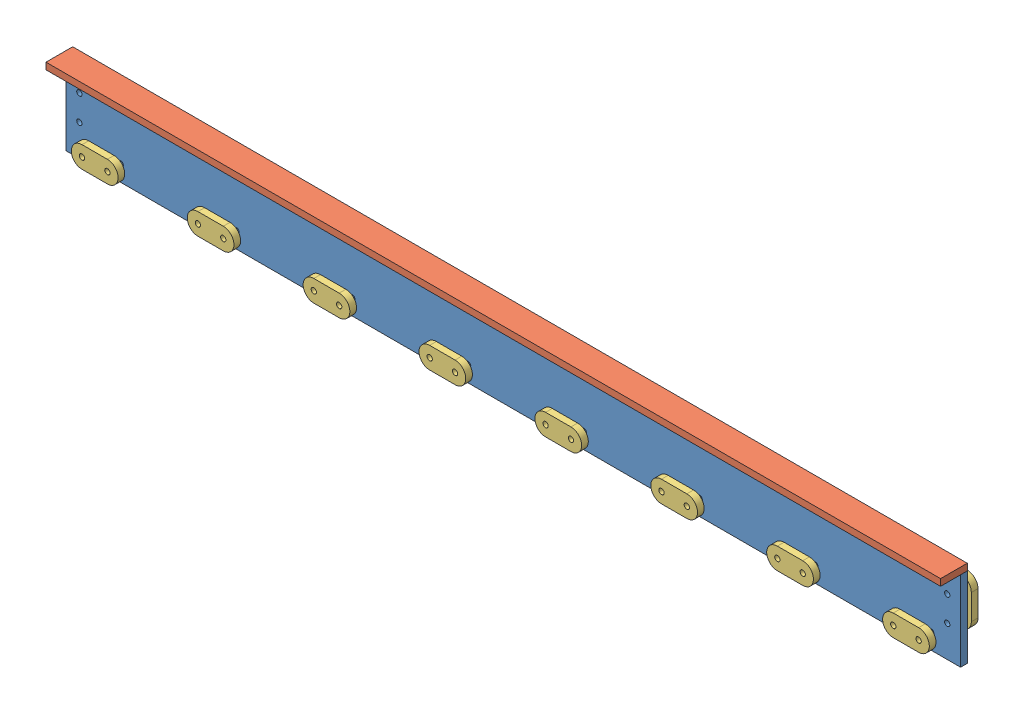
SolidWorks assembly fs-bs-right-mount-assembly.SLDASM, configuration Default (file format 9000). Lengths in mm.
Overall size (850.9 82.55 38.15).
12 component instances, 3 part files, 8 mates.
Components (placement in the parent):
- fs-bs-right-mount-vertical-component-1: fs-bs-right-mount-vertical-component.SLDPRT [Default] at origin size (850.9 76.2 6.35)
- fs-bs-right-mount-horizontal-component-1: fs-bs-right-mount-horizontal-component.SLDPRT [Default] at (425.45 76.2 12.7) size (850.9 6.35 25.4)
- fs-clamp-1: fs-clamp.SLDPRT [Default] at (27.94 15.24 12.7326) size (44.45 20.32 6.35)
- fs-clamp-11: fs-clamp.SLDPRT [Default] at (12.7 29.845 -12.7409) x (0 1 0) z (0 0 1) size (44.45 20.32 6.35)
- fs-clamp-12: fs-clamp.SLDPRT [Default] at (838.2 29.845 -6.3972) x (0 1 0) z (0 0 -1) size (44.45 20.32 6.35)
- fs-clamp-4: fs-clamp.SLDPRT [Default] at (138.176 15.24 12.7326) size (44.45 20.32 6.35)
- fs-clamp-5: fs-clamp.SLDPRT [Default] at (248.412 15.24 12.7326) size (44.45 20.32 6.35)
- fs-clamp-6: fs-clamp.SLDPRT [Default] at (358.648 15.24 12.7326) size (44.45 20.32 6.35)
- fs-clamp-7: fs-clamp.SLDPRT [Default] at (468.884 15.24 12.7326) size (44.45 20.32 6.35)
- fs-clamp-8: fs-clamp.SLDPRT [Default] at (579.12 15.24 12.7326) size (44.45 20.32 6.35)
- fs-clamp-9: fs-clamp.SLDPRT [Default] at (689.356 15.24 12.7326) size (44.45 20.32 6.35)
- fs-clamp-10: fs-clamp.SLDPRT [Default] at (799.592 15.24 12.7326) size (44.45 20.32 6.35)
Mates (geometry in assembly coordinates):
- Coincident1: coincident aligned: line of fs-bs-right-mount-vertical-component-1 through (850.9 850.9 76.2) axis (0 -1 0); line of fs-bs-right-mount-horizontal-component-1 through (850.9 850.9 76.2) axis (0 -1 0)
- Coincident2: coincident anti-aligned: line of fs-bs-right-mount-vertical-component-1 through (0 76.2 6.35) axis (0 0 -1); line of fs-bs-right-mount-horizontal-component-1 through (0 76.2 0) axis (0 0 1)
- Concentric1: concentric anti-aligned: cylinder of fs-bs-right-mount-vertical-component-1 through (27.94 15.24 -7.1842) axis (0 0 1) radius 2.54; cylinder of fs-clamp-1 through (27.94 15.24 19.0826) axis (0 0 -1) radius 2.54
- Concentric2: concentric anti-aligned: cylinder of fs-bs-right-mount-vertical-component-1 through (52.07 15.24 -7.1842) axis (0 0 1) radius 2.54; cylinder of fs-clamp-1 through (52.07 15.24 19.0826) axis (0 0 -1) radius 2.54
- Concentric3: concentric anti-aligned: cylinder of fs-bs-right-mount-vertical-component-1 through (12.7 29.845 -7.1842) axis (0 0 1) radius 2.54; cylinder of fs-clamp-11 through (12.7 29.845 -6.3909) axis (0 0 -1) radius 2.54
- Concentric4: concentric anti-aligned: cylinder of fs-bs-right-mount-vertical-component-1 through (12.7 53.975 -7.1842) axis (0 0 1) radius 2.54; cylinder of fs-clamp-11 through (12.7 53.975 -6.3909) axis (0 0 -1) radius 2.54
- Concentric5: concentric aligned: cylinder of fs-bs-right-mount-vertical-component-1 through (838.2 53.975 -7.1842) axis (0 0 1) radius 2.54; cylinder of fs-clamp-12 through (838.2 53.975 -12.7472) axis (0 0 1) radius 2.54
- Concentric6: concentric aligned: cylinder of fs-bs-right-mount-vertical-component-1 through (838.2 29.845 -7.1842) axis (0 0 1) radius 2.54; cylinder of fs-clamp-12 through (838.2 29.845 -12.7472) axis (0 0 1) radius 2.54
